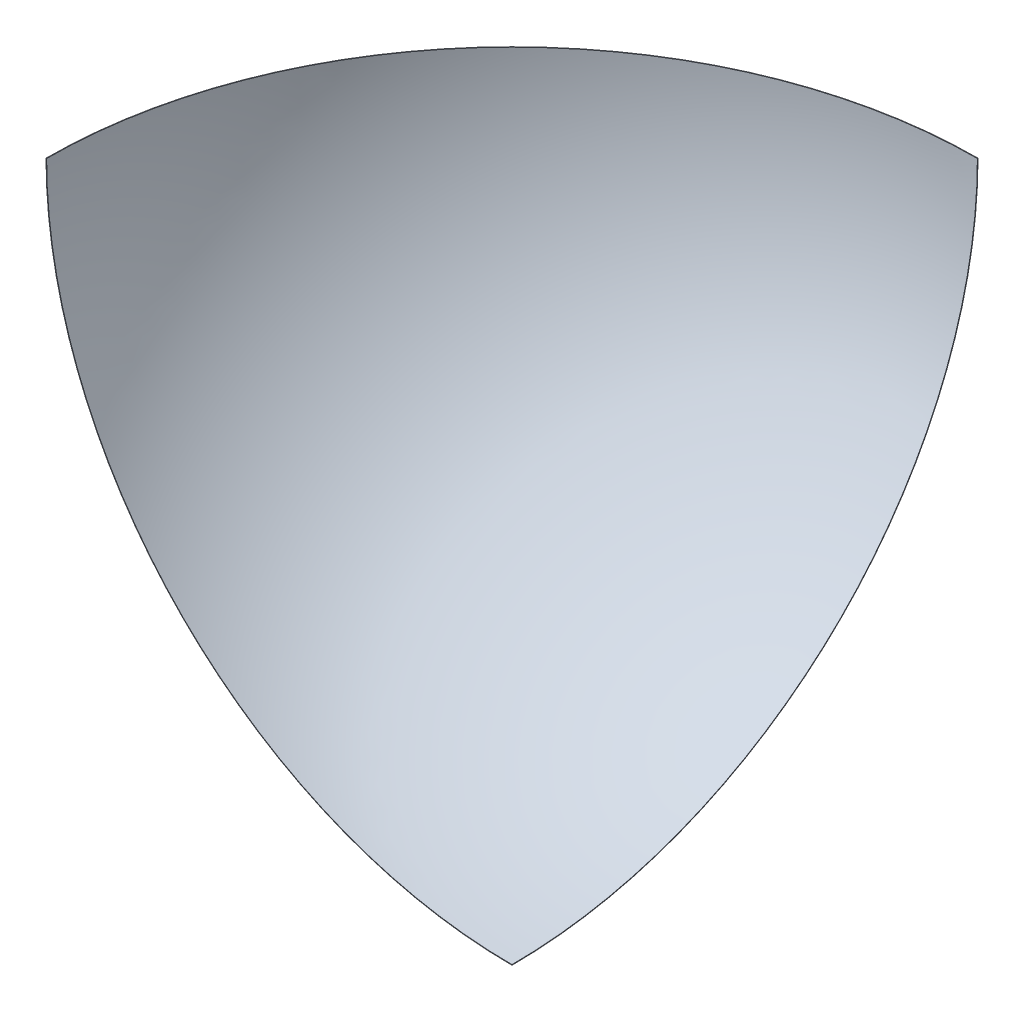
ISO-10303-21;
HEADER;
FILE_DESCRIPTION(('STEP AP214'),'2;1');
FILE_NAME('part.step','',(''),(''),'','','');
FILE_SCHEMA(('AUTOMOTIVE_DESIGN { 1 0 10303 214 1 1 1 1 }'));
ENDSEC;
DATA;
#1=APPLICATION_CONTEXT('core data for automotive mechanical design processes');
#2=APPLICATION_PROTOCOL_DEFINITION('international standard','automotive_design',2000,#1);
#3=PRODUCT_CONTEXT('',#1,'mechanical');
#4=PRODUCT('Part','Part','',(#3));
#5=PRODUCT_RELATED_PRODUCT_CATEGORY('part','',(#4));
#6=PRODUCT_DEFINITION_FORMATION('','',#4);
#7=PRODUCT_DEFINITION_CONTEXT('part definition',#1,'design');
#8=PRODUCT_DEFINITION('design','',#6,#7);
#9=PRODUCT_DEFINITION_SHAPE('','',#8);
#10=(LENGTH_UNIT() NAMED_UNIT(*) SI_UNIT(.MILLI.,.METRE.));
#11=(NAMED_UNIT(*) PLANE_ANGLE_UNIT() SI_UNIT($,.RADIAN.));
#12=(NAMED_UNIT(*) SI_UNIT($,.STERADIAN.) SOLID_ANGLE_UNIT());
#13=UNCERTAINTY_MEASURE_WITH_UNIT(LENGTH_MEASURE(1.E-05),#10,'distance_accuracy_value','');
#14=(GEOMETRIC_REPRESENTATION_CONTEXT(3) GLOBAL_UNCERTAINTY_ASSIGNED_CONTEXT((#13)) GLOBAL_UNIT_ASSIGNED_CONTEXT((#10,
#11,#12)) REPRESENTATION_CONTEXT('',''));
#15=CARTESIAN_POINT('',(0.,0.,0.));
#16=DIRECTION('',(0.,0.,1.));
#17=DIRECTION('',(1.,0.,0.));
#18=AXIS2_PLACEMENT_3D('',#15,#16,#17);
#19=CARTESIAN_POINT('',(0.,0.,-1.11022302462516E-13));
#20=DIRECTION('',(0.,0.,-1.));
#21=DIRECTION('',(0.,1.,0.));
#22=AXIS2_PLACEMENT_3D('',#19,#20,#21);
#23=SPHERICAL_SURFACE('',#22,1224.28);
#24=CARTESIAN_POINT('',(0.,0.,0.));
#25=DIRECTION('',(0.,0.,-1.));
#26=DIRECTION('',(-1.,0.,0.));
#27=AXIS2_PLACEMENT_3D('',#24,#25,#26);
#28=CIRCLE('',#27,1224.28);
#29=CARTESIAN_POINT('',(4.27455077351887E-12,-1224.28,-1.11022302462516E-13));
#30=VERTEX_POINT('',#29);
#31=CARTESIAN_POINT('',(-1224.28,0.,-1.11022302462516E-13));
#32=VERTEX_POINT('',#31);
#33=EDGE_CURVE('E11',#30,#32,#28,.T.);
#34=ORIENTED_EDGE('',*,*,#33,.T.);
#35=CARTESIAN_POINT('',(0.,0.,-1.11022302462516E-13));
#36=DIRECTION('',(0.,1.,0.));
#37=DIRECTION('',(0.,0.,1.));
#38=AXIS2_PLACEMENT_3D('',#35,#36,#37);
#39=CIRCLE('',#38,1224.28);
#40=CARTESIAN_POINT('',(0.,0.,-1224.28));
#41=VERTEX_POINT('',#40);
#42=EDGE_CURVE('E58',#41,#32,#39,.T.);
#43=ORIENTED_EDGE('',*,*,#42,.F.);
#44=CARTESIAN_POINT('',(0.,0.,-1.11022302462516E-13));
#45=DIRECTION('',(-1.,0.,0.));
#46=DIRECTION('',(0.,0.,1.));
#47=AXIS2_PLACEMENT_3D('',#44,#45,#46);
#48=CIRCLE('',#47,1224.28);
#49=EDGE_CURVE('E76',#41,#30,#48,.T.);
#50=ORIENTED_EDGE('',*,*,#49,.T.);
#51=EDGE_LOOP('',(#34,#43,#50));
#52=FACE_BOUND('',#51,.T.);
#53=ADVANCED_FACE('F44',(#52),#23,.T.);
#54=CARTESIAN_POINT('',(4.26900804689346E-12,-1222.6925,-2.23324786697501E-13));
#55=DIRECTION('',(0.,0.,1.));
#56=DIRECTION('',(1.,0.,0.));
#57=AXIS2_PLACEMENT_3D('',#54,#55,#56);
#58=PLANE('',#57);
#59=CARTESIAN_POINT('',(0.,0.,-4.44089209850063E-13));
#60=DIRECTION('',(0.,0.,-1.));
#61=DIRECTION('',(-1.,0.,0.));
#62=AXIS2_PLACEMENT_3D('',#59,#60,#61);
#63=CIRCLE('',#62,1222.6925);
#64=CARTESIAN_POINT('',(4.26900804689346E-12,-1222.6925,-3.35627270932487E-13));
#65=VERTEX_POINT('',#64);
#66=CARTESIAN_POINT('',(-1222.6925,0.,-3.35627270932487E-13));
#67=VERTEX_POINT('',#66);
#68=EDGE_CURVE('E53',#65,#67,#63,.T.);
#69=ORIENTED_EDGE('',*,*,#68,.T.);
#70=DIRECTION('',(1.,0.,-1.88644592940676E-13));
#71=VECTOR('',#70,1.);
#72=CARTESIAN_POINT('',(-1222.6925,0.,-4.10495593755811E-13));
#73=LINE('',#72,#71);
#74=EDGE_CURVE('E87',#32,#67,#73,.T.);
#75=ORIENTED_EDGE('',*,*,#74,.F.);
#76=ORIENTED_EDGE('',*,*,#33,.F.);
#77=DIRECTION('',(0.,1.,-1.88644592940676E-13));
#78=VECTOR('',#77,1.);
#79=CARTESIAN_POINT('',(4.26900804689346E-12,-1222.6925,-4.10495593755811E-13));
#80=LINE('',#79,#78);
#81=EDGE_CURVE('E97',#30,#65,#80,.T.);
#82=ORIENTED_EDGE('',*,*,#81,.T.);
#83=EDGE_LOOP('',(#69,#75,#76,#82));
#84=FACE_BOUND('',#83,.T.);
#85=ADVANCED_FACE('F50',(#84),#58,.T.);
#86=CARTESIAN_POINT('',(0.,0.,-1.11022302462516E-13));
#87=DIRECTION('',(0.,0.,-1.));
#88=DIRECTION('',(0.,-1.,0.));
#89=AXIS2_PLACEMENT_3D('',#86,#87,#88);
#90=SPHERICAL_SURFACE('',#89,1222.6925);
#91=CARTESIAN_POINT('',(0.,0.,-1.11022302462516E-13));
#92=DIRECTION('',(0.,-1.,0.));
#93=DIRECTION('',(0.,0.,1.));
#94=AXIS2_PLACEMENT_3D('',#91,#92,#93);
#95=CIRCLE('',#94,1222.6925);
#96=CARTESIAN_POINT('',(0.,2.24604968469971E-13,-1222.6925));
#97=VERTEX_POINT('',#96);
#98=EDGE_CURVE('E95',#67,#97,#95,.T.);
#99=ORIENTED_EDGE('',*,*,#98,.F.);
#100=ORIENTED_EDGE('',*,*,#68,.F.);
#101=CARTESIAN_POINT('',(0.,0.,-1.11022302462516E-13));
#102=DIRECTION('',(1.,0.,0.));
#103=DIRECTION('',(0.,0.,1.));
#104=AXIS2_PLACEMENT_3D('',#101,#102,#103);
#105=CIRCLE('',#104,1222.6925);
#106=EDGE_CURVE('E105',#65,#97,#105,.T.);
#107=ORIENTED_EDGE('',*,*,#106,.T.);
#108=EDGE_LOOP('',(#99,#100,#107));
#109=FACE_BOUND('',#108,.T.);
#110=ADVANCED_FACE('F108',(#109),#90,.F.);
#111=CARTESIAN_POINT('',(0.,0.,-1.11022302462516E-13));
#112=DIRECTION('',(-1.,0.,0.));
#113=DIRECTION('',(0.,0.,1.));
#114=AXIS2_PLACEMENT_3D('',#111,#112,#113);
#115=PLANE('',#114);
#116=ORIENTED_EDGE('',*,*,#49,.F.);
#117=DIRECTION('',(0.,-1.41483444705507E-13,-1.));
#118=VECTOR('',#117,1.);
#119=CARTESIAN_POINT('',(0.,2.24604968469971E-13,-1222.6925));
#120=LINE('',#119,#118);
#121=EDGE_CURVE('E70',#97,#41,#120,.T.);
#122=ORIENTED_EDGE('',*,*,#121,.F.);
#123=ORIENTED_EDGE('',*,*,#106,.F.);
#124=ORIENTED_EDGE('',*,*,#81,.F.);
#125=EDGE_LOOP('',(#116,#122,#123,#124));
#126=FACE_BOUND('',#125,.T.);
#127=ADVANCED_FACE('F109',(#126),#115,.F.);
#128=CARTESIAN_POINT('',(0.,0.,-1.11022302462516E-13));
#129=DIRECTION('',(0.,1.,0.));
#130=DIRECTION('',(0.,0.,1.));
#131=AXIS2_PLACEMENT_3D('',#128,#129,#130);
#132=PLANE('',#131);
#133=ORIENTED_EDGE('',*,*,#42,.T.);
#134=ORIENTED_EDGE('',*,*,#74,.T.);
#135=ORIENTED_EDGE('',*,*,#98,.T.);
#136=ORIENTED_EDGE('',*,*,#121,.T.);
#137=EDGE_LOOP('',(#133,#134,#135,#136));
#138=FACE_BOUND('',#137,.T.);
#139=ADVANCED_FACE('F88',(#138),#132,.T.);
#140=CLOSED_SHELL('',(#53,#85,#110,#127,#139));
#141=MANIFOLD_SOLID_BREP('B2',#140);
#142=ADVANCED_BREP_SHAPE_REPRESENTATION('',(#18,#141),#14);
#143=SHAPE_DEFINITION_REPRESENTATION(#9,#142);
ENDSEC;
END-ISO-10303-21;
